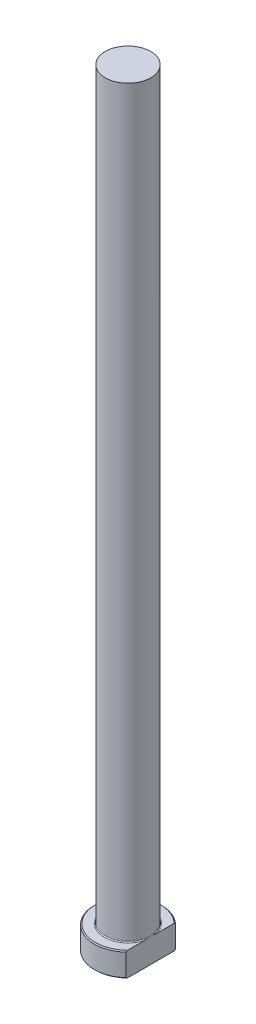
from build123d import *
from build123d.topology import SkipClean

# Parameters (mm, degrees)
CHAMFER1_SIZE = 0.2
FILLET1_R     = 0.2
KEY_DEPTH     = 161.305957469


with BuildPart() as part:
    # Sketch1 → Revolve1 (revolve)
    with BuildSketch(Plane.XY, mode=Mode.PRIVATE) as revolve1_sk:
        Polygon((0, 0), (-7, 0), (-7, 5), (-4.75, 5), (-4.75, 160), (0, 160), align=None)
    revolve(revolve1_sk.sketch.rotate(Axis((0, 259.958771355, 0), (0, -1, 0)), 270), axis=Axis((0, 259.958771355, 0), (0, -1, 0)))

    # Chamfer1
    chamfer1_edges = [part.edges().sort_by_distance(p)[0] for p in [
        (0, 5, -7),
        (0, 0, -7),
    ]]
    chamfer(chamfer1_edges, length=CHAMFER1_SIZE)

    # Fillet1
    fillet1_edges = [part.edges().sort_by_distance(p)[0] for p in [
        (0, 5, -4.75),
    ]]
    fillet(fillet1_edges, radius=FILLET1_R)

    # Sketch2 → KEY (cut, through all)
    with SkipClean():  # the faces are left unmerged after this step: merging them gives an invalid solid
        with BuildSketch(Plane(origin=(0, 0, 0), x_dir=(1, 0, 0), z_dir=(0, 1, 0))):
            with BuildLine():
                Line((4.75, 5.14174095), (4.75, -5.14174095))
                ThreePointArc((4.75, -5.14174095), (7, 0), (4.75, 5.14174095))
            make_face()
        extrude(amount=KEY_DEPTH, mode=Mode.SUBTRACT)


solid = part.part
